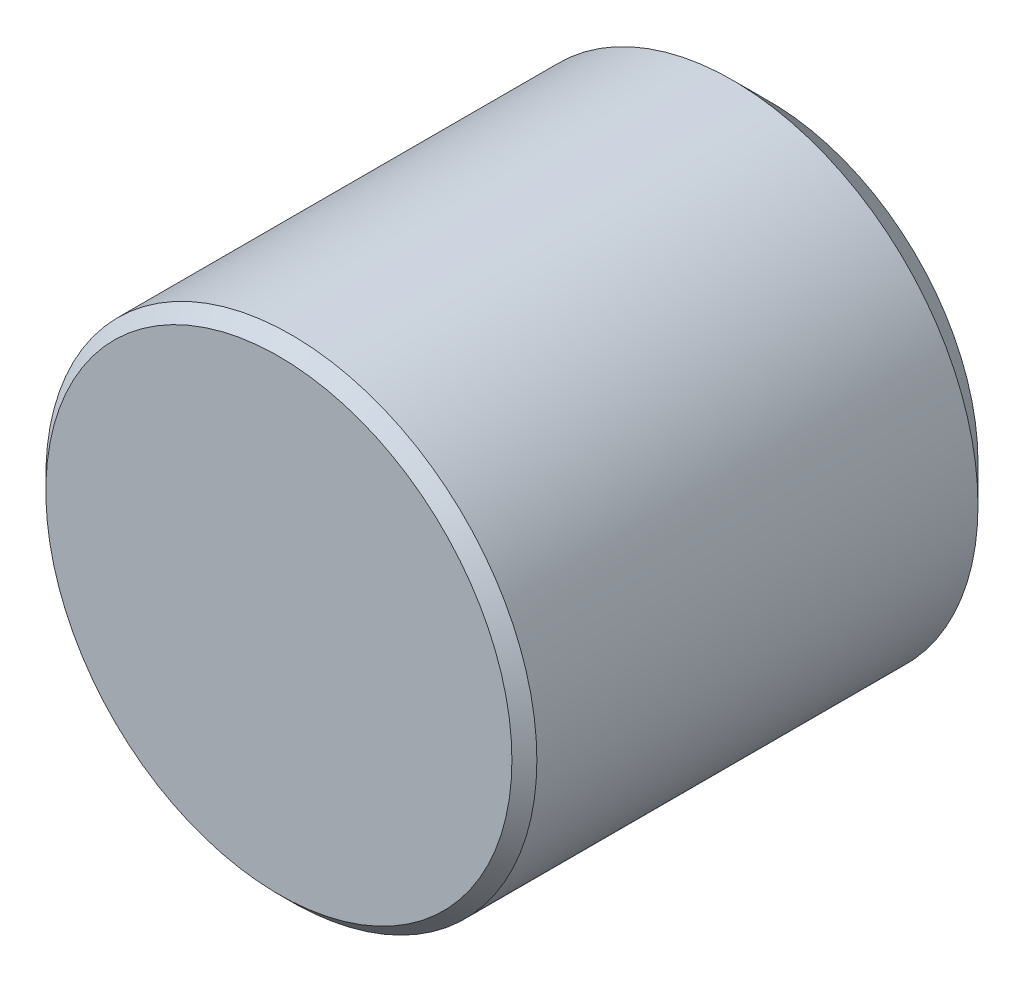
ISO-10303-21;
HEADER;
FILE_DESCRIPTION(('STEP AP214'),'2;1');
FILE_NAME('part.step','',(''),(''),'','','');
FILE_SCHEMA(('AUTOMOTIVE_DESIGN { 1 0 10303 214 1 1 1 1 }'));
ENDSEC;
DATA;
#1=APPLICATION_CONTEXT('core data for automotive mechanical design processes');
#2=APPLICATION_PROTOCOL_DEFINITION('international standard','automotive_design',2000,#1);
#3=PRODUCT_CONTEXT('',#1,'mechanical');
#4=PRODUCT('Part','Part','',(#3));
#5=PRODUCT_RELATED_PRODUCT_CATEGORY('part','',(#4));
#6=PRODUCT_DEFINITION_FORMATION('','',#4);
#7=PRODUCT_DEFINITION_CONTEXT('part definition',#1,'design');
#8=PRODUCT_DEFINITION('design','',#6,#7);
#9=PRODUCT_DEFINITION_SHAPE('','',#8);
#10=(LENGTH_UNIT() NAMED_UNIT(*) SI_UNIT(.MILLI.,.METRE.));
#11=(NAMED_UNIT(*) PLANE_ANGLE_UNIT() SI_UNIT($,.RADIAN.));
#12=(NAMED_UNIT(*) SI_UNIT($,.STERADIAN.) SOLID_ANGLE_UNIT());
#13=UNCERTAINTY_MEASURE_WITH_UNIT(LENGTH_MEASURE(1.E-05),#10,'distance_accuracy_value','');
#14=(GEOMETRIC_REPRESENTATION_CONTEXT(3) GLOBAL_UNCERTAINTY_ASSIGNED_CONTEXT((#13)) GLOBAL_UNIT_ASSIGNED_CONTEXT((#10,
#11,#12)) REPRESENTATION_CONTEXT('',''));
#15=CARTESIAN_POINT('',(0.,0.,0.));
#16=DIRECTION('',(0.,0.,1.));
#17=DIRECTION('',(1.,0.,0.));
#18=AXIS2_PLACEMENT_3D('',#15,#16,#17);
#19=CARTESIAN_POINT('',(0.,0.,0.));
#20=DIRECTION('',(0.,0.,1.));
#21=DIRECTION('',(1.,0.,0.));
#22=AXIS2_PLACEMENT_3D('',#19,#20,#21);
#23=PLANE('',#22);
#24=CARTESIAN_POINT('',(0.,0.,0.));
#25=DIRECTION('',(0.,0.,-1.));
#26=DIRECTION('',(-1.,0.,0.));
#27=AXIS2_PLACEMENT_3D('',#24,#25,#26);
#28=CIRCLE('',#27,2.5);
#29=CARTESIAN_POINT('',(-2.5,0.,0.));
#30=VERTEX_POINT('',#29);
#31=EDGE_CURVE('E33',#30,#30,#28,.T.);
#32=ORIENTED_EDGE('',*,*,#31,.F.);
#33=EDGE_LOOP('',(#32));
#34=FACE_BOUND('',#33,.T.);
#35=CARTESIAN_POINT('',(0.,0.,0.));
#36=DIRECTION('',(0.,0.,1.));
#37=DIRECTION('',(1.,0.,0.));
#38=AXIS2_PLACEMENT_3D('',#35,#36,#37);
#39=CIRCLE('',#38,4.238);
#40=CARTESIAN_POINT('',(4.238,0.,0.));
#41=VERTEX_POINT('',#40);
#42=EDGE_CURVE('E23',#41,#41,#39,.F.);
#43=ORIENTED_EDGE('',*,*,#42,.T.);
#44=EDGE_LOOP('',(#43));
#45=FACE_BOUND('',#44,.T.);
#46=ADVANCED_FACE('F12',(#34,#45),#23,.F.);
#47=CARTESIAN_POINT('',(0.,0.,10.));
#48=DIRECTION('',(0.,0.,-1.));
#49=DIRECTION('',(-1.,0.,0.));
#50=AXIS2_PLACEMENT_3D('',#47,#48,#49);
#51=CYLINDRICAL_SURFACE('',#50,5.);
#52=CARTESIAN_POINT('',(0.,0.,9.746));
#53=DIRECTION('',(0.,0.,1.));
#54=DIRECTION('',(1.,0.,0.));
#55=AXIS2_PLACEMENT_3D('',#52,#53,#54);
#56=CIRCLE('',#55,5.);
#57=CARTESIAN_POINT('',(5.,0.,9.746));
#58=VERTEX_POINT('',#57);
#59=EDGE_CURVE('E8',#58,#58,#56,.F.);
#60=ORIENTED_EDGE('',*,*,#59,.T.);
#61=EDGE_LOOP('',(#60));
#62=FACE_BOUND('',#61,.T.);
#63=CARTESIAN_POINT('',(0.,0.,0.762));
#64=DIRECTION('',(0.,0.,1.));
#65=DIRECTION('',(1.,0.,0.));
#66=AXIS2_PLACEMENT_3D('',#63,#64,#65);
#67=CIRCLE('',#66,5.);
#68=CARTESIAN_POINT('',(5.,0.,0.762));
#69=VERTEX_POINT('',#68);
#70=EDGE_CURVE('E27',#69,#69,#67,.T.);
#71=ORIENTED_EDGE('',*,*,#70,.T.);
#72=EDGE_LOOP('',(#71));
#73=FACE_BOUND('',#72,.T.);
#74=ADVANCED_FACE('F49',(#62,#73),#51,.T.);
#75=CARTESIAN_POINT('',(0.,0.,10.));
#76=DIRECTION('',(0.,0.,1.));
#77=DIRECTION('',(1.,0.,0.));
#78=AXIS2_PLACEMENT_3D('',#75,#76,#77);
#79=PLANE('',#78);
#80=CARTESIAN_POINT('',(0.,0.,10.));
#81=DIRECTION('',(0.,0.,1.));
#82=DIRECTION('',(1.,0.,0.));
#83=AXIS2_PLACEMENT_3D('',#80,#81,#82);
#84=CIRCLE('',#83,4.746);
#85=CARTESIAN_POINT('',(4.746,0.,10.));
#86=VERTEX_POINT('',#85);
#87=EDGE_CURVE('E19',#86,#86,#84,.T.);
#88=ORIENTED_EDGE('',*,*,#87,.T.);
#89=EDGE_LOOP('',(#88));
#90=FACE_BOUND('',#89,.T.);
#91=ADVANCED_FACE('F56',(#90),#79,.T.);
#92=CARTESIAN_POINT('',(0.,0.,0.762));
#93=DIRECTION('',(0.,0.,1.));
#94=DIRECTION('',(1.,0.,0.));
#95=AXIS2_PLACEMENT_3D('',#92,#93,#94);
#96=CONICAL_SURFACE('',#95,5.,0.78539816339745);
#97=ORIENTED_EDGE('',*,*,#42,.F.);
#98=EDGE_LOOP('',(#97));
#99=FACE_BOUND('',#98,.T.);
#100=ORIENTED_EDGE('',*,*,#70,.F.);
#101=EDGE_LOOP('',(#100));
#102=FACE_BOUND('',#101,.T.);
#103=ADVANCED_FACE('F53',(#99,#102),#96,.T.);
#104=CARTESIAN_POINT('',(0.,0.,10.));
#105=DIRECTION('',(0.,0.,-1.));
#106=DIRECTION('',(-1.,0.,0.));
#107=AXIS2_PLACEMENT_3D('',#104,#105,#106);
#108=CONICAL_SURFACE('',#107,4.746,0.785398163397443);
#109=ORIENTED_EDGE('',*,*,#59,.F.);
#110=EDGE_LOOP('',(#109));
#111=FACE_BOUND('',#110,.T.);
#112=ORIENTED_EDGE('',*,*,#87,.F.);
#113=EDGE_LOOP('',(#112));
#114=FACE_BOUND('',#113,.T.);
#115=ADVANCED_FACE('F14',(#111,#114),#108,.T.);
#116=CARTESIAN_POINT('',(0.,0.,5.));
#117=DIRECTION('',(0.,0.,-1.));
#118=DIRECTION('',(-1.,0.,0.));
#119=AXIS2_PLACEMENT_3D('',#116,#117,#118);
#120=CYLINDRICAL_SURFACE('',#119,2.5);
#121=CARTESIAN_POINT('',(0.,0.,5.));
#122=DIRECTION('',(0.,0.,-1.));
#123=DIRECTION('',(-1.,0.,0.));
#124=AXIS2_PLACEMENT_3D('',#121,#122,#123);
#125=CIRCLE('',#124,2.5);
#126=CARTESIAN_POINT('',(-2.5,0.,5.));
#127=VERTEX_POINT('',#126);
#128=EDGE_CURVE('E32',#127,#127,#125,.T.);
#129=ORIENTED_EDGE('',*,*,#128,.F.);
#130=EDGE_LOOP('',(#129));
#131=FACE_BOUND('',#130,.T.);
#132=ORIENTED_EDGE('',*,*,#31,.T.);
#133=EDGE_LOOP('',(#132));
#134=FACE_BOUND('',#133,.T.);
#135=ADVANCED_FACE('F41',(#131,#134),#120,.F.);
#136=CARTESIAN_POINT('',(0.,0.,5.));
#137=DIRECTION('',(0.,0.,-1.));
#138=DIRECTION('',(-1.,0.,0.));
#139=AXIS2_PLACEMENT_3D('',#136,#137,#138);
#140=PLANE('',#139);
#141=ORIENTED_EDGE('',*,*,#128,.T.);
#142=EDGE_LOOP('',(#141));
#143=FACE_BOUND('',#142,.T.);
#144=ADVANCED_FACE('F39',(#143),#140,.T.);
#145=CLOSED_SHELL('',(#46,#74,#91,#103,#115,#135,#144));
#146=MANIFOLD_SOLID_BREP('B1',#145);
#147=ADVANCED_BREP_SHAPE_REPRESENTATION('',(#18,#146),#14);
#148=SHAPE_DEFINITION_REPRESENTATION(#9,#147);
ENDSEC;
END-ISO-10303-21;
